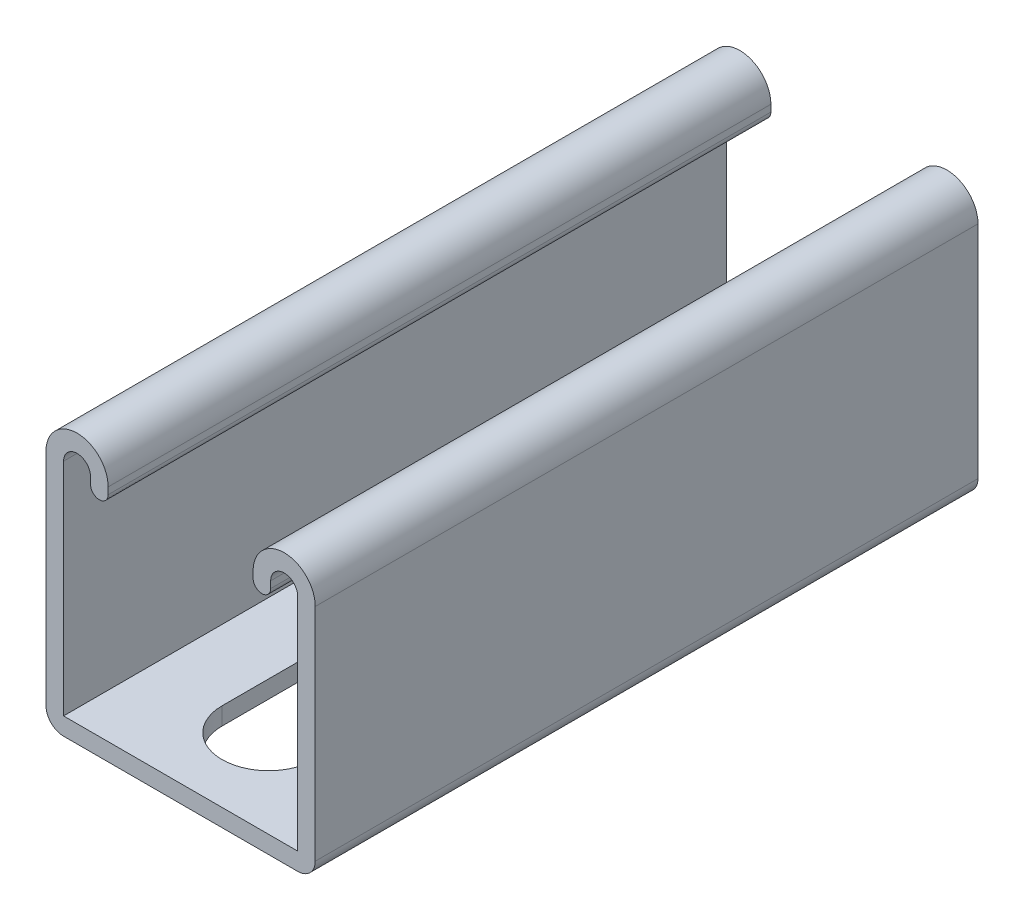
ISO-10303-21;
HEADER;
FILE_DESCRIPTION(('STEP AP214'),'2;1');
FILE_NAME('part.step','',(''),(''),'','','');
FILE_SCHEMA(('AUTOMOTIVE_DESIGN { 1 0 10303 214 1 1 1 1 }'));
ENDSEC;
DATA;
#1=APPLICATION_CONTEXT('core data for automotive mechanical design processes');
#2=APPLICATION_PROTOCOL_DEFINITION('international standard','automotive_design',2000,#1);
#3=PRODUCT_CONTEXT('',#1,'mechanical');
#4=PRODUCT('Part','Part','',(#3));
#5=PRODUCT_RELATED_PRODUCT_CATEGORY('part','',(#4));
#6=PRODUCT_DEFINITION_FORMATION('','',#4);
#7=PRODUCT_DEFINITION_CONTEXT('part definition',#1,'design');
#8=PRODUCT_DEFINITION('design','',#6,#7);
#9=PRODUCT_DEFINITION_SHAPE('','',#8);
#10=(LENGTH_UNIT() NAMED_UNIT(*) SI_UNIT(.MILLI.,.METRE.));
#11=(NAMED_UNIT(*) PLANE_ANGLE_UNIT() SI_UNIT($,.RADIAN.));
#12=(NAMED_UNIT(*) SI_UNIT($,.STERADIAN.) SOLID_ANGLE_UNIT());
#13=UNCERTAINTY_MEASURE_WITH_UNIT(LENGTH_MEASURE(1.E-05),#10,'distance_accuracy_value','');
#14=(GEOMETRIC_REPRESENTATION_CONTEXT(3) GLOBAL_UNCERTAINTY_ASSIGNED_CONTEXT((#13)) GLOBAL_UNIT_ASSIGNED_CONTEXT((#10,
#11,#12)) REPRESENTATION_CONTEXT('',''));
#15=CARTESIAN_POINT('',(0.,0.,0.));
#16=DIRECTION('',(0.,0.,1.));
#17=DIRECTION('',(1.,0.,0.));
#18=AXIS2_PLACEMENT_3D('',#15,#16,#17);
#19=CARTESIAN_POINT('',(-15.875,18.4785,101.6));
#20=DIRECTION('',(0.,0.,-1.));
#21=DIRECTION('',(-1.,0.,0.));
#22=AXIS2_PLACEMENT_3D('',#19,#20,#21);
#23=CYLINDRICAL_SURFACE('',#22,4.7625);
#24=CARTESIAN_POINT('',(-15.875,18.4785,0.));
#25=DIRECTION('',(0.,0.,1.));
#26=DIRECTION('',(-1.,0.,0.));
#27=AXIS2_PLACEMENT_3D('',#24,#25,#26);
#28=CIRCLE('',#27,4.7625);
#29=CARTESIAN_POINT('',(-11.1125,18.4785,0.));
#30=VERTEX_POINT('',#29);
#31=CARTESIAN_POINT('',(-20.6375,18.4785,0.));
#32=VERTEX_POINT('',#31);
#33=EDGE_CURVE('E253',#30,#32,#28,.T.);
#34=ORIENTED_EDGE('',*,*,#33,.T.);
#35=DIRECTION('',(0.,0.,-1.));
#36=VECTOR('',#35,1.);
#37=CARTESIAN_POINT('',(-20.6375,18.4785,101.6));
#38=LINE('',#37,#36);
#39=CARTESIAN_POINT('',(-20.6375,18.4785,101.6));
#40=VERTEX_POINT('',#39);
#41=EDGE_CURVE('E384',#40,#32,#38,.T.);
#42=ORIENTED_EDGE('',*,*,#41,.F.);
#43=CARTESIAN_POINT('',(-15.875,18.4785,101.6));
#44=DIRECTION('',(0.,0.,1.));
#45=DIRECTION('',(-1.,0.,0.));
#46=AXIS2_PLACEMENT_3D('',#43,#44,#45);
#47=CIRCLE('',#46,4.7625);
#48=CARTESIAN_POINT('',(-11.1125,18.4785,101.6));
#49=VERTEX_POINT('',#48);
#50=EDGE_CURVE('E260',#49,#40,#47,.T.);
#51=ORIENTED_EDGE('',*,*,#50,.F.);
#52=DIRECTION('',(0.,0.,-1.));
#53=VECTOR('',#52,1.);
#54=CARTESIAN_POINT('',(-11.1125,18.4785,101.6));
#55=LINE('',#54,#53);
#56=EDGE_CURVE('E298',#49,#30,#55,.T.);
#57=ORIENTED_EDGE('',*,*,#56,.T.);
#58=EDGE_LOOP('',(#34,#42,#51,#57));
#59=FACE_BOUND('',#58,.T.);
#60=ADVANCED_FACE('F32',(#59),#23,.T.);
#61=CARTESIAN_POINT('',(-20.6375,18.4785,101.6));
#62=DIRECTION('',(1.,0.,0.));
#63=DIRECTION('',(0.,1.,0.));
#64=AXIS2_PLACEMENT_3D('',#61,#62,#63);
#65=PLANE('',#64);
#66=DIRECTION('',(0.,-1.,0.));
#67=VECTOR('',#66,1.);
#68=CARTESIAN_POINT('',(-20.6375,18.4785,0.));
#69=LINE('',#68,#67);
#70=CARTESIAN_POINT('',(-20.6375,-15.3416,0.));
#71=VERTEX_POINT('',#70);
#72=EDGE_CURVE('E301',#32,#71,#69,.T.);
#73=ORIENTED_EDGE('',*,*,#72,.T.);
#74=DIRECTION('',(0.,0.,-1.));
#75=VECTOR('',#74,1.);
#76=CARTESIAN_POINT('',(-20.6375,-15.3416,101.6));
#77=LINE('',#76,#75);
#78=CARTESIAN_POINT('',(-20.6375,-15.3416,101.6));
#79=VERTEX_POINT('',#78);
#80=EDGE_CURVE('E381',#79,#71,#77,.T.);
#81=ORIENTED_EDGE('',*,*,#80,.F.);
#82=DIRECTION('',(0.,-1.,0.));
#83=VECTOR('',#82,1.);
#84=CARTESIAN_POINT('',(-20.6375,18.4785,101.6));
#85=LINE('',#84,#83);
#86=EDGE_CURVE('E263',#40,#79,#85,.T.);
#87=ORIENTED_EDGE('',*,*,#86,.F.);
#88=ORIENTED_EDGE('',*,*,#41,.T.);
#89=EDGE_LOOP('',(#73,#81,#87,#88));
#90=FACE_BOUND('',#89,.T.);
#91=ADVANCED_FACE('F425',(#90),#65,.F.);
#92=CARTESIAN_POINT('',(-17.9451,-15.3416,101.6));
#93=DIRECTION('',(0.,0.,-1.));
#94=DIRECTION('',(-1.,0.,0.));
#95=AXIS2_PLACEMENT_3D('',#92,#93,#94);
#96=CYLINDRICAL_SURFACE('',#95,2.6924);
#97=CARTESIAN_POINT('',(-17.9451,-15.3416,0.));
#98=DIRECTION('',(0.,0.,1.));
#99=DIRECTION('',(-1.,0.,0.));
#100=AXIS2_PLACEMENT_3D('',#97,#98,#99);
#101=CIRCLE('',#100,2.6924);
#102=CARTESIAN_POINT('',(-17.9451,-18.034,0.));
#103=VERTEX_POINT('',#102);
#104=EDGE_CURVE('E303',#71,#103,#101,.T.);
#105=ORIENTED_EDGE('',*,*,#104,.T.);
#106=DIRECTION('',(0.,0.,-1.));
#107=VECTOR('',#106,1.);
#108=CARTESIAN_POINT('',(-17.9451,-18.034,101.6));
#109=LINE('',#108,#107);
#110=CARTESIAN_POINT('',(-17.9451,-18.034,101.6));
#111=VERTEX_POINT('',#110);
#112=EDGE_CURVE('E378',#111,#103,#109,.T.);
#113=ORIENTED_EDGE('',*,*,#112,.F.);
#114=CARTESIAN_POINT('',(-17.9451,-15.3416,101.6));
#115=DIRECTION('',(0.,0.,1.));
#116=DIRECTION('',(-1.,0.,0.));
#117=AXIS2_PLACEMENT_3D('',#114,#115,#116);
#118=CIRCLE('',#117,2.6924);
#119=EDGE_CURVE('E266',#79,#111,#118,.T.);
#120=ORIENTED_EDGE('',*,*,#119,.F.);
#121=ORIENTED_EDGE('',*,*,#80,.T.);
#122=EDGE_LOOP('',(#105,#113,#120,#121));
#123=FACE_BOUND('',#122,.T.);
#124=ADVANCED_FACE('F430',(#123),#96,.T.);
#125=CARTESIAN_POINT('',(-17.9451,-18.034,101.6));
#126=DIRECTION('',(0.,1.,0.));
#127=DIRECTION('',(-1.,0.,0.));
#128=AXIS2_PLACEMENT_3D('',#125,#126,#127);
#129=PLANE('',#128);
#130=DIRECTION('',(0.,0.,-1.));
#131=VECTOR('',#130,1.);
#132=CARTESIAN_POINT('',(-7.14375,-18.0340000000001,73.81875));
#133=LINE('',#132,#131);
#134=CARTESIAN_POINT('',(-7.14375,-18.034,88.10625));
#135=VERTEX_POINT('',#134);
#136=CARTESIAN_POINT('',(-7.14375,-18.0340000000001,73.81875));
#137=VERTEX_POINT('',#136);
#138=EDGE_CURVE('E206',#135,#137,#133,.T.);
#139=ORIENTED_EDGE('',*,*,#138,.F.);
#140=CARTESIAN_POINT('',(0.,-18.0340000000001,88.10625));
#141=DIRECTION('',(0.,-1.,0.));
#142=DIRECTION('',(1.,0.,0.));
#143=AXIS2_PLACEMENT_3D('',#140,#141,#142);
#144=CIRCLE('',#143,7.14375);
#145=CARTESIAN_POINT('',(7.14375,-18.0340000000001,88.10625));
#146=VERTEX_POINT('',#145);
#147=EDGE_CURVE('E46',#146,#135,#144,.T.);
#148=ORIENTED_EDGE('',*,*,#147,.F.);
#149=DIRECTION('',(0.,0.,1.));
#150=VECTOR('',#149,1.);
#151=CARTESIAN_POINT('',(7.14375,-18.0340000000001,88.10625));
#152=LINE('',#151,#150);
#153=CARTESIAN_POINT('',(7.14375,-18.0340000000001,73.81875));
#154=VERTEX_POINT('',#153);
#155=EDGE_CURVE('E222',#154,#146,#152,.T.);
#156=ORIENTED_EDGE('',*,*,#155,.F.);
#157=CARTESIAN_POINT('',(0.,-18.0340000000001,73.81875));
#158=DIRECTION('',(0.,-1.,0.));
#159=DIRECTION('',(1.,0.,0.));
#160=AXIS2_PLACEMENT_3D('',#157,#158,#159);
#161=CIRCLE('',#160,7.14375);
#162=EDGE_CURVE('E216',#137,#154,#161,.T.);
#163=ORIENTED_EDGE('',*,*,#162,.F.);
#164=EDGE_LOOP('',(#139,#148,#156,#163));
#165=FACE_BOUND('',#164,.T.);
#166=DIRECTION('',(0.,0.,-1.));
#167=VECTOR('',#166,1.);
#168=CARTESIAN_POINT('',(-7.14375,-18.0340000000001,23.01875));
#169=LINE('',#168,#167);
#170=CARTESIAN_POINT('',(-7.14375,-18.034,37.30625));
#171=VERTEX_POINT('',#170);
#172=CARTESIAN_POINT('',(-7.14375,-18.0340000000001,23.01875));
#173=VERTEX_POINT('',#172);
#174=EDGE_CURVE('E241',#171,#173,#169,.T.);
#175=ORIENTED_EDGE('',*,*,#174,.F.);
#176=CARTESIAN_POINT('',(0.,-18.0340000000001,37.30625));
#177=DIRECTION('',(0.,-1.,0.));
#178=DIRECTION('',(1.,0.,0.));
#179=AXIS2_PLACEMENT_3D('',#176,#177,#178);
#180=CIRCLE('',#179,7.14375);
#181=CARTESIAN_POINT('',(7.14375,-18.0340000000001,37.30625));
#182=VERTEX_POINT('',#181);
#183=EDGE_CURVE('E239',#182,#171,#180,.T.);
#184=ORIENTED_EDGE('',*,*,#183,.F.);
#185=DIRECTION('',(0.,0.,1.));
#186=VECTOR('',#185,1.);
#187=CARTESIAN_POINT('',(7.14375,-18.0340000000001,37.30625));
#188=LINE('',#187,#186);
#189=CARTESIAN_POINT('',(7.14375,-18.0340000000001,23.01875));
#190=VERTEX_POINT('',#189);
#191=EDGE_CURVE('E247',#190,#182,#188,.T.);
#192=ORIENTED_EDGE('',*,*,#191,.F.);
#193=CARTESIAN_POINT('',(0.,-18.0340000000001,23.01875));
#194=DIRECTION('',(0.,-1.,0.));
#195=DIRECTION('',(1.,0.,0.));
#196=AXIS2_PLACEMENT_3D('',#193,#194,#195);
#197=CIRCLE('',#196,7.14375);
#198=EDGE_CURVE('E244',#173,#190,#197,.T.);
#199=ORIENTED_EDGE('',*,*,#198,.F.);
#200=EDGE_LOOP('',(#175,#184,#192,#199));
#201=FACE_BOUND('',#200,.T.);
#202=DIRECTION('',(1.,0.,0.));
#203=VECTOR('',#202,1.);
#204=CARTESIAN_POINT('',(-17.9451,-18.034,0.));
#205=LINE('',#204,#203);
#206=CARTESIAN_POINT('',(17.9451,-18.034,0.));
#207=VERTEX_POINT('',#206);
#208=EDGE_CURVE('E305',#103,#207,#205,.T.);
#209=ORIENTED_EDGE('',*,*,#208,.T.);
#210=DIRECTION('',(0.,0.,-1.));
#211=VECTOR('',#210,1.);
#212=CARTESIAN_POINT('',(17.9451,-18.034,101.6));
#213=LINE('',#212,#211);
#214=CARTESIAN_POINT('',(17.9451,-18.034,101.6));
#215=VERTEX_POINT('',#214);
#216=EDGE_CURVE('E375',#215,#207,#213,.T.);
#217=ORIENTED_EDGE('',*,*,#216,.F.);
#218=DIRECTION('',(1.,0.,0.));
#219=VECTOR('',#218,1.);
#220=CARTESIAN_POINT('',(-17.9451,-18.034,101.6));
#221=LINE('',#220,#219);
#222=EDGE_CURVE('E268',#111,#215,#221,.T.);
#223=ORIENTED_EDGE('',*,*,#222,.F.);
#224=ORIENTED_EDGE('',*,*,#112,.T.);
#225=EDGE_LOOP('',(#209,#217,#223,#224));
#226=FACE_BOUND('',#225,.T.);
#227=ADVANCED_FACE('F220',(#165,#201,#226),#129,.F.);
#228=CARTESIAN_POINT('',(17.9451,-15.3416,101.6));
#229=DIRECTION('',(0.,0.,-1.));
#230=DIRECTION('',(-1.,0.,0.));
#231=AXIS2_PLACEMENT_3D('',#228,#229,#230);
#232=CYLINDRICAL_SURFACE('',#231,2.6924);
#233=CARTESIAN_POINT('',(17.9451,-15.3416,0.));
#234=DIRECTION('',(0.,0.,1.));
#235=DIRECTION('',(1.,0.,0.));
#236=AXIS2_PLACEMENT_3D('',#233,#234,#235);
#237=CIRCLE('',#236,2.6924);
#238=CARTESIAN_POINT('',(20.6375,-15.3416,0.));
#239=VERTEX_POINT('',#238);
#240=EDGE_CURVE('E307',#207,#239,#237,.T.);
#241=ORIENTED_EDGE('',*,*,#240,.T.);
#242=DIRECTION('',(0.,0.,-1.));
#243=VECTOR('',#242,1.);
#244=CARTESIAN_POINT('',(20.6375,-15.3416,101.6));
#245=LINE('',#244,#243);
#246=CARTESIAN_POINT('',(20.6375,-15.3416,101.6));
#247=VERTEX_POINT('',#246);
#248=EDGE_CURVE('E372',#247,#239,#245,.T.);
#249=ORIENTED_EDGE('',*,*,#248,.F.);
#250=CARTESIAN_POINT('',(17.9451,-15.3416,101.6));
#251=DIRECTION('',(0.,0.,1.));
#252=DIRECTION('',(1.,0.,0.));
#253=AXIS2_PLACEMENT_3D('',#250,#251,#252);
#254=CIRCLE('',#253,2.6924);
#255=EDGE_CURVE('E270',#215,#247,#254,.T.);
#256=ORIENTED_EDGE('',*,*,#255,.F.);
#257=ORIENTED_EDGE('',*,*,#216,.T.);
#258=EDGE_LOOP('',(#241,#249,#256,#257));
#259=FACE_BOUND('',#258,.T.);
#260=ADVANCED_FACE('F510',(#259),#232,.T.);
#261=CARTESIAN_POINT('',(20.6375,-15.3416,101.6));
#262=DIRECTION('',(-1.,0.,0.));
#263=DIRECTION('',(0.,0.,1.));
#264=AXIS2_PLACEMENT_3D('',#261,#262,#263);
#265=PLANE('',#264);
#266=DIRECTION('',(0.,1.,0.));
#267=VECTOR('',#266,1.);
#268=CARTESIAN_POINT('',(20.6375,-15.3416,0.));
#269=LINE('',#268,#267);
#270=CARTESIAN_POINT('',(20.6375,18.4785,0.));
#271=VERTEX_POINT('',#270);
#272=EDGE_CURVE('E309',#239,#271,#269,.T.);
#273=ORIENTED_EDGE('',*,*,#272,.T.);
#274=DIRECTION('',(0.,0.,-1.));
#275=VECTOR('',#274,1.);
#276=CARTESIAN_POINT('',(20.6375,18.4785,101.6));
#277=LINE('',#276,#275);
#278=CARTESIAN_POINT('',(20.6375,18.4785,101.6));
#279=VERTEX_POINT('',#278);
#280=EDGE_CURVE('E369',#279,#271,#277,.T.);
#281=ORIENTED_EDGE('',*,*,#280,.F.);
#282=DIRECTION('',(0.,1.,0.));
#283=VECTOR('',#282,1.);
#284=CARTESIAN_POINT('',(20.6375,-15.3416,101.6));
#285=LINE('',#284,#283);
#286=EDGE_CURVE('E272',#247,#279,#285,.T.);
#287=ORIENTED_EDGE('',*,*,#286,.F.);
#288=ORIENTED_EDGE('',*,*,#248,.T.);
#289=EDGE_LOOP('',(#273,#281,#287,#288));
#290=FACE_BOUND('',#289,.T.);
#291=ADVANCED_FACE('F506',(#290),#265,.F.);
#292=CARTESIAN_POINT('',(15.875,18.4785,101.6));
#293=DIRECTION('',(0.,0.,-1.));
#294=DIRECTION('',(-1.,0.,0.));
#295=AXIS2_PLACEMENT_3D('',#292,#293,#294);
#296=CYLINDRICAL_SURFACE('',#295,4.7625);
#297=CARTESIAN_POINT('',(15.875,18.4785,0.));
#298=DIRECTION('',(0.,0.,1.));
#299=DIRECTION('',(1.,0.,0.));
#300=AXIS2_PLACEMENT_3D('',#297,#298,#299);
#301=CIRCLE('',#300,4.7625);
#302=CARTESIAN_POINT('',(11.1125,18.4785,0.));
#303=VERTEX_POINT('',#302);
#304=EDGE_CURVE('E311',#271,#303,#301,.T.);
#305=ORIENTED_EDGE('',*,*,#304,.T.);
#306=DIRECTION('',(0.,0.,-1.));
#307=VECTOR('',#306,1.);
#308=CARTESIAN_POINT('',(11.1125,18.4785,101.6));
#309=LINE('',#308,#307);
#310=CARTESIAN_POINT('',(11.1125,18.4785,101.6));
#311=VERTEX_POINT('',#310);
#312=EDGE_CURVE('E366',#311,#303,#309,.T.);
#313=ORIENTED_EDGE('',*,*,#312,.F.);
#314=CARTESIAN_POINT('',(15.875,18.4785,101.6));
#315=DIRECTION('',(0.,0.,1.));
#316=DIRECTION('',(1.,0.,0.));
#317=AXIS2_PLACEMENT_3D('',#314,#315,#316);
#318=CIRCLE('',#317,4.7625);
#319=EDGE_CURVE('E274',#279,#311,#318,.T.);
#320=ORIENTED_EDGE('',*,*,#319,.F.);
#321=ORIENTED_EDGE('',*,*,#280,.T.);
#322=EDGE_LOOP('',(#305,#313,#320,#321));
#323=FACE_BOUND('',#322,.T.);
#324=ADVANCED_FACE('F501',(#323),#296,.T.);
#325=CARTESIAN_POINT('',(11.1125,18.4785,101.6));
#326=DIRECTION('',(1.,0.,0.));
#327=DIRECTION('',(0.,1.,0.));
#328=AXIS2_PLACEMENT_3D('',#325,#326,#327);
#329=PLANE('',#328);
#330=DIRECTION('',(0.,-1.,0.));
#331=VECTOR('',#330,1.);
#332=CARTESIAN_POINT('',(11.1125,18.4785,0.));
#333=LINE('',#332,#331);
#334=CARTESIAN_POINT('',(11.1125,17.44345,0.));
#335=VERTEX_POINT('',#334);
#336=EDGE_CURVE('E313',#303,#335,#333,.T.);
#337=ORIENTED_EDGE('',*,*,#336,.T.);
#338=DIRECTION('',(0.,0.,-1.));
#339=VECTOR('',#338,1.);
#340=CARTESIAN_POINT('',(11.1125,17.44345,101.6));
#341=LINE('',#340,#339);
#342=CARTESIAN_POINT('',(11.1125,17.44345,101.6));
#343=VERTEX_POINT('',#342);
#344=EDGE_CURVE('E363',#343,#335,#341,.T.);
#345=ORIENTED_EDGE('',*,*,#344,.F.);
#346=DIRECTION('',(0.,-1.,0.));
#347=VECTOR('',#346,1.);
#348=CARTESIAN_POINT('',(11.1125,18.4785,101.6));
#349=LINE('',#348,#347);
#350=EDGE_CURVE('E276',#311,#343,#349,.T.);
#351=ORIENTED_EDGE('',*,*,#350,.F.);
#352=ORIENTED_EDGE('',*,*,#312,.T.);
#353=EDGE_LOOP('',(#337,#345,#351,#352));
#354=FACE_BOUND('',#353,.T.);
#355=ADVANCED_FACE('F495',(#354),#329,.F.);
#356=CARTESIAN_POINT('',(12.4587,17.44345,101.6));
#357=DIRECTION('',(0.,0.,-1.));
#358=DIRECTION('',(-1.,0.,0.));
#359=AXIS2_PLACEMENT_3D('',#356,#357,#358);
#360=CYLINDRICAL_SURFACE('',#359,1.3462);
#361=CARTESIAN_POINT('',(12.4587,17.44345,0.));
#362=DIRECTION('',(0.,0.,1.));
#363=DIRECTION('',(1.,0.,0.));
#364=AXIS2_PLACEMENT_3D('',#361,#362,#363);
#365=CIRCLE('',#364,1.3462);
#366=CARTESIAN_POINT('',(13.8049,17.44345,0.));
#367=VERTEX_POINT('',#366);
#368=EDGE_CURVE('E315',#335,#367,#365,.T.);
#369=ORIENTED_EDGE('',*,*,#368,.T.);
#370=DIRECTION('',(0.,0.,-1.));
#371=VECTOR('',#370,1.);
#372=CARTESIAN_POINT('',(13.8049,17.44345,101.6));
#373=LINE('',#372,#371);
#374=CARTESIAN_POINT('',(13.8049,17.44345,101.6));
#375=VERTEX_POINT('',#374);
#376=EDGE_CURVE('E360',#375,#367,#373,.T.);
#377=ORIENTED_EDGE('',*,*,#376,.F.);
#378=CARTESIAN_POINT('',(12.4587,17.44345,101.6));
#379=DIRECTION('',(0.,0.,1.));
#380=DIRECTION('',(1.,0.,0.));
#381=AXIS2_PLACEMENT_3D('',#378,#379,#380);
#382=CIRCLE('',#381,1.3462);
#383=EDGE_CURVE('E278',#343,#375,#382,.T.);
#384=ORIENTED_EDGE('',*,*,#383,.F.);
#385=ORIENTED_EDGE('',*,*,#344,.T.);
#386=EDGE_LOOP('',(#369,#377,#384,#385));
#387=FACE_BOUND('',#386,.T.);
#388=ADVANCED_FACE('F491',(#387),#360,.T.);
#389=CARTESIAN_POINT('',(13.8049,18.4785,101.6));
#390=DIRECTION('',(-1.,0.,0.));
#391=DIRECTION('',(0.,0.,1.));
#392=AXIS2_PLACEMENT_3D('',#389,#390,#391);
#393=PLANE('',#392);
#394=DIRECTION('',(0.,1.,0.));
#395=VECTOR('',#394,1.);
#396=CARTESIAN_POINT('',(13.8049,18.4785,0.));
#397=LINE('',#396,#395);
#398=CARTESIAN_POINT('',(13.8049,18.4785,0.));
#399=VERTEX_POINT('',#398);
#400=EDGE_CURVE('E317',#367,#399,#397,.T.);
#401=ORIENTED_EDGE('',*,*,#400,.T.);
#402=DIRECTION('',(0.,0.,-1.));
#403=VECTOR('',#402,1.);
#404=CARTESIAN_POINT('',(13.8049,18.4785,101.6));
#405=LINE('',#404,#403);
#406=CARTESIAN_POINT('',(13.8049,18.4785,101.6));
#407=VERTEX_POINT('',#406);
#408=EDGE_CURVE('E357',#407,#399,#405,.T.);
#409=ORIENTED_EDGE('',*,*,#408,.F.);
#410=DIRECTION('',(0.,1.,0.));
#411=VECTOR('',#410,1.);
#412=CARTESIAN_POINT('',(13.8049,18.4785,101.6));
#413=LINE('',#412,#411);
#414=EDGE_CURVE('E280',#375,#407,#413,.T.);
#415=ORIENTED_EDGE('',*,*,#414,.F.);
#416=ORIENTED_EDGE('',*,*,#376,.T.);
#417=EDGE_LOOP('',(#401,#409,#415,#416));
#418=FACE_BOUND('',#417,.T.);
#419=ADVANCED_FACE('F486',(#418),#393,.F.);
#420=CARTESIAN_POINT('',(15.875,18.4785,101.6));
#421=DIRECTION('',(0.,0.,-1.));
#422=DIRECTION('',(-1.,0.,0.));
#423=AXIS2_PLACEMENT_3D('',#420,#421,#422);
#424=CYLINDRICAL_SURFACE('',#423,2.0701);
#425=CARTESIAN_POINT('',(15.875,18.4785,0.));
#426=DIRECTION('',(0.,0.,-1.));
#427=DIRECTION('',(1.,0.,0.));
#428=AXIS2_PLACEMENT_3D('',#425,#426,#427);
#429=CIRCLE('',#428,2.0701);
#430=CARTESIAN_POINT('',(17.9451,18.4785,0.));
#431=VERTEX_POINT('',#430);
#432=EDGE_CURVE('E319',#399,#431,#429,.T.);
#433=ORIENTED_EDGE('',*,*,#432,.T.);
#434=DIRECTION('',(0.,0.,-1.));
#435=VECTOR('',#434,1.);
#436=CARTESIAN_POINT('',(17.9451,18.4785,101.6));
#437=LINE('',#436,#435);
#438=CARTESIAN_POINT('',(17.9451,18.4785,101.6));
#439=VERTEX_POINT('',#438);
#440=EDGE_CURVE('E354',#439,#431,#437,.T.);
#441=ORIENTED_EDGE('',*,*,#440,.F.);
#442=CARTESIAN_POINT('',(15.875,18.4785,101.6));
#443=DIRECTION('',(0.,0.,-1.));
#444=DIRECTION('',(1.,0.,0.));
#445=AXIS2_PLACEMENT_3D('',#442,#443,#444);
#446=CIRCLE('',#445,2.0701);
#447=EDGE_CURVE('E282',#407,#439,#446,.T.);
#448=ORIENTED_EDGE('',*,*,#447,.F.);
#449=ORIENTED_EDGE('',*,*,#408,.T.);
#450=EDGE_LOOP('',(#433,#441,#448,#449));
#451=FACE_BOUND('',#450,.T.);
#452=ADVANCED_FACE('F480',(#451),#424,.F.);
#453=CARTESIAN_POINT('',(17.9451,-15.3416,101.6));
#454=DIRECTION('',(1.,0.,0.));
#455=DIRECTION('',(0.,1.,0.));
#456=AXIS2_PLACEMENT_3D('',#453,#454,#455);
#457=PLANE('',#456);
#458=DIRECTION('',(0.,-1.,0.));
#459=VECTOR('',#458,1.);
#460=CARTESIAN_POINT('',(17.9451,-15.3416,0.));
#461=LINE('',#460,#459);
#462=CARTESIAN_POINT('',(17.9451,-15.3416,0.));
#463=VERTEX_POINT('',#462);
#464=EDGE_CURVE('E321',#431,#463,#461,.T.);
#465=ORIENTED_EDGE('',*,*,#464,.T.);
#466=DIRECTION('',(0.,0.,-1.));
#467=VECTOR('',#466,1.);
#468=CARTESIAN_POINT('',(17.9451,-15.3416,101.6));
#469=LINE('',#468,#467);
#470=CARTESIAN_POINT('',(17.9451,-15.3416,101.6));
#471=VERTEX_POINT('',#470);
#472=EDGE_CURVE('E351',#471,#463,#469,.T.);
#473=ORIENTED_EDGE('',*,*,#472,.F.);
#474=DIRECTION('',(0.,-1.,0.));
#475=VECTOR('',#474,1.);
#476=CARTESIAN_POINT('',(17.9451,-15.3416,101.6));
#477=LINE('',#476,#475);
#478=EDGE_CURVE('E284',#439,#471,#477,.T.);
#479=ORIENTED_EDGE('',*,*,#478,.F.);
#480=ORIENTED_EDGE('',*,*,#440,.T.);
#481=EDGE_LOOP('',(#465,#473,#479,#480));
#482=FACE_BOUND('',#481,.T.);
#483=ADVANCED_FACE('F476',(#482),#457,.F.);
#484=CARTESIAN_POINT('',(-17.9451,-15.3416,101.6));
#485=DIRECTION('',(0.,-1.,0.));
#486=DIRECTION('',(1.,0.,0.));
#487=AXIS2_PLACEMENT_3D('',#484,#485,#486);
#488=PLANE('',#487);
#489=DIRECTION('',(0.,0.,1.));
#490=VECTOR('',#489,1.);
#491=CARTESIAN_POINT('',(7.14375,-15.3416,152.4));
#492=LINE('',#491,#490);
#493=CARTESIAN_POINT('',(7.14375,-15.3416,73.81875));
#494=VERTEX_POINT('',#493);
#495=CARTESIAN_POINT('',(7.14375,-15.3416,88.10625));
#496=VERTEX_POINT('',#495);
#497=EDGE_CURVE('E232',#494,#496,#492,.T.);
#498=ORIENTED_EDGE('',*,*,#497,.T.);
#499=CARTESIAN_POINT('',(0.,-15.3416,88.10625));
#500=DIRECTION('',(0.,-1.,0.));
#501=DIRECTION('',(1.,0.,0.));
#502=AXIS2_PLACEMENT_3D('',#499,#500,#501);
#503=CIRCLE('',#502,7.14375);
#504=CARTESIAN_POINT('',(-7.14375,-15.3416,88.10625));
#505=VERTEX_POINT('',#504);
#506=EDGE_CURVE('E236',#496,#505,#503,.T.);
#507=ORIENTED_EDGE('',*,*,#506,.T.);
#508=DIRECTION('',(0.,0.,-1.));
#509=VECTOR('',#508,1.);
#510=CARTESIAN_POINT('',(-7.14375,-15.3416,152.4));
#511=LINE('',#510,#509);
#512=CARTESIAN_POINT('',(-7.14375,-15.3416,73.81875));
#513=VERTEX_POINT('',#512);
#514=EDGE_CURVE('E213',#505,#513,#511,.T.);
#515=ORIENTED_EDGE('',*,*,#514,.T.);
#516=CARTESIAN_POINT('',(0.,-15.3416,73.81875));
#517=DIRECTION('',(0.,-1.,0.));
#518=DIRECTION('',(1.,0.,0.));
#519=AXIS2_PLACEMENT_3D('',#516,#517,#518);
#520=CIRCLE('',#519,7.14375);
#521=EDGE_CURVE('E54',#513,#494,#520,.T.);
#522=ORIENTED_EDGE('',*,*,#521,.T.);
#523=EDGE_LOOP('',(#498,#507,#515,#522));
#524=FACE_BOUND('',#523,.T.);
#525=DIRECTION('',(0.,0.,1.));
#526=VECTOR('',#525,1.);
#527=CARTESIAN_POINT('',(7.14375,-15.3416,101.6));
#528=LINE('',#527,#526);
#529=CARTESIAN_POINT('',(7.14375,-15.3416,23.01875));
#530=VERTEX_POINT('',#529);
#531=CARTESIAN_POINT('',(7.14375,-15.3416,37.30625));
#532=VERTEX_POINT('',#531);
#533=EDGE_CURVE('E39',#530,#532,#528,.T.);
#534=ORIENTED_EDGE('',*,*,#533,.T.);
#535=CARTESIAN_POINT('',(0.,-15.3416,37.30625));
#536=DIRECTION('',(0.,-1.,0.));
#537=DIRECTION('',(1.,0.,0.));
#538=AXIS2_PLACEMENT_3D('',#535,#536,#537);
#539=CIRCLE('',#538,7.14375);
#540=CARTESIAN_POINT('',(-7.14375,-15.3416,37.30625));
#541=VERTEX_POINT('',#540);
#542=EDGE_CURVE('E11',#532,#541,#539,.T.);
#543=ORIENTED_EDGE('',*,*,#542,.T.);
#544=DIRECTION('',(0.,0.,-1.));
#545=VECTOR('',#544,1.);
#546=CARTESIAN_POINT('',(-7.14375,-15.3416,101.6));
#547=LINE('',#546,#545);
#548=CARTESIAN_POINT('',(-7.14375,-15.3416,23.01875));
#549=VERTEX_POINT('',#548);
#550=EDGE_CURVE('E387',#541,#549,#547,.T.);
#551=ORIENTED_EDGE('',*,*,#550,.T.);
#552=CARTESIAN_POINT('',(0.,-15.3416,23.01875));
#553=DIRECTION('',(0.,-1.,0.));
#554=DIRECTION('',(1.,0.,0.));
#555=AXIS2_PLACEMENT_3D('',#552,#553,#554);
#556=CIRCLE('',#555,7.14375);
#557=EDGE_CURVE('E390',#549,#530,#556,.T.);
#558=ORIENTED_EDGE('',*,*,#557,.T.);
#559=EDGE_LOOP('',(#534,#543,#551,#558));
#560=FACE_BOUND('',#559,.T.);
#561=DIRECTION('',(-1.,0.,0.));
#562=VECTOR('',#561,1.);
#563=CARTESIAN_POINT('',(-17.9451,-15.3416,0.));
#564=LINE('',#563,#562);
#565=CARTESIAN_POINT('',(-17.9451,-15.3416,0.));
#566=VERTEX_POINT('',#565);
#567=EDGE_CURVE('E323',#463,#566,#564,.T.);
#568=ORIENTED_EDGE('',*,*,#567,.T.);
#569=DIRECTION('',(0.,0.,-1.));
#570=VECTOR('',#569,1.);
#571=CARTESIAN_POINT('',(-17.9451,-15.3416,101.6));
#572=LINE('',#571,#570);
#573=CARTESIAN_POINT('',(-17.9451,-15.3416,101.6));
#574=VERTEX_POINT('',#573);
#575=EDGE_CURVE('E348',#574,#566,#572,.T.);
#576=ORIENTED_EDGE('',*,*,#575,.F.);
#577=DIRECTION('',(-1.,0.,0.));
#578=VECTOR('',#577,1.);
#579=CARTESIAN_POINT('',(-17.9451,-15.3416,101.6));
#580=LINE('',#579,#578);
#581=EDGE_CURVE('E286',#471,#574,#580,.T.);
#582=ORIENTED_EDGE('',*,*,#581,.F.);
#583=ORIENTED_EDGE('',*,*,#472,.T.);
#584=EDGE_LOOP('',(#568,#576,#582,#583));
#585=FACE_BOUND('',#584,.T.);
#586=ADVANCED_FACE('F394',(#524,#560,#585),#488,.F.);
#587=CARTESIAN_POINT('',(-17.9451,18.4785,101.6));
#588=DIRECTION('',(-1.,0.,0.));
#589=DIRECTION('',(0.,-1.,0.));
#590=AXIS2_PLACEMENT_3D('',#587,#588,#589);
#591=PLANE('',#590);
#592=DIRECTION('',(0.,1.,0.));
#593=VECTOR('',#592,1.);
#594=CARTESIAN_POINT('',(-17.9451,18.4785,0.));
#595=LINE('',#594,#593);
#596=CARTESIAN_POINT('',(-17.9451,18.4785,0.));
#597=VERTEX_POINT('',#596);
#598=EDGE_CURVE('E325',#566,#597,#595,.T.);
#599=ORIENTED_EDGE('',*,*,#598,.T.);
#600=DIRECTION('',(0.,0.,-1.));
#601=VECTOR('',#600,1.);
#602=CARTESIAN_POINT('',(-17.9451,18.4785,101.6));
#603=LINE('',#602,#601);
#604=CARTESIAN_POINT('',(-17.9451,18.4785,101.6));
#605=VERTEX_POINT('',#604);
#606=EDGE_CURVE('E345',#605,#597,#603,.T.);
#607=ORIENTED_EDGE('',*,*,#606,.F.);
#608=DIRECTION('',(0.,1.,0.));
#609=VECTOR('',#608,1.);
#610=CARTESIAN_POINT('',(-17.9451,18.4785,101.6));
#611=LINE('',#610,#609);
#612=EDGE_CURVE('E288',#574,#605,#611,.T.);
#613=ORIENTED_EDGE('',*,*,#612,.F.);
#614=ORIENTED_EDGE('',*,*,#575,.T.);
#615=EDGE_LOOP('',(#599,#607,#613,#614));
#616=FACE_BOUND('',#615,.T.);
#617=ADVANCED_FACE('F467',(#616),#591,.F.);
#618=CARTESIAN_POINT('',(-15.875,18.4785,101.6));
#619=DIRECTION('',(0.,0.,-1.));
#620=DIRECTION('',(-1.,0.,0.));
#621=AXIS2_PLACEMENT_3D('',#618,#619,#620);
#622=CYLINDRICAL_SURFACE('',#621,2.0701);
#623=CARTESIAN_POINT('',(-15.875,18.4785,0.));
#624=DIRECTION('',(0.,0.,-1.));
#625=DIRECTION('',(-1.,0.,0.));
#626=AXIS2_PLACEMENT_3D('',#623,#624,#625);
#627=CIRCLE('',#626,2.0701);
#628=CARTESIAN_POINT('',(-13.8049,18.4785,0.));
#629=VERTEX_POINT('',#628);
#630=EDGE_CURVE('E327',#597,#629,#627,.T.);
#631=ORIENTED_EDGE('',*,*,#630,.T.);
#632=DIRECTION('',(0.,0.,-1.));
#633=VECTOR('',#632,1.);
#634=CARTESIAN_POINT('',(-13.8049,18.4785,101.6));
#635=LINE('',#634,#633);
#636=CARTESIAN_POINT('',(-13.8049,18.4785,101.6));
#637=VERTEX_POINT('',#636);
#638=EDGE_CURVE('E342',#637,#629,#635,.T.);
#639=ORIENTED_EDGE('',*,*,#638,.F.);
#640=CARTESIAN_POINT('',(-15.875,18.4785,101.6));
#641=DIRECTION('',(0.,0.,-1.));
#642=DIRECTION('',(-1.,0.,0.));
#643=AXIS2_PLACEMENT_3D('',#640,#641,#642);
#644=CIRCLE('',#643,2.0701);
#645=EDGE_CURVE('E290',#605,#637,#644,.T.);
#646=ORIENTED_EDGE('',*,*,#645,.F.);
#647=ORIENTED_EDGE('',*,*,#606,.T.);
#648=EDGE_LOOP('',(#631,#639,#646,#647));
#649=FACE_BOUND('',#648,.T.);
#650=ADVANCED_FACE('F463',(#649),#622,.F.);
#651=CARTESIAN_POINT('',(-13.8049,18.4785,101.6));
#652=DIRECTION('',(1.,0.,0.));
#653=DIRECTION('',(0.,1.,0.));
#654=AXIS2_PLACEMENT_3D('',#651,#652,#653);
#655=PLANE('',#654);
#656=DIRECTION('',(0.,-1.,0.));
#657=VECTOR('',#656,1.);
#658=CARTESIAN_POINT('',(-13.8049,18.4785,0.));
#659=LINE('',#658,#657);
#660=CARTESIAN_POINT('',(-13.8049,17.44345,0.));
#661=VERTEX_POINT('',#660);
#662=EDGE_CURVE('E329',#629,#661,#659,.T.);
#663=ORIENTED_EDGE('',*,*,#662,.T.);
#664=DIRECTION('',(0.,0.,-1.));
#665=VECTOR('',#664,1.);
#666=CARTESIAN_POINT('',(-13.8049,17.44345,101.6));
#667=LINE('',#666,#665);
#668=CARTESIAN_POINT('',(-13.8049,17.44345,101.6));
#669=VERTEX_POINT('',#668);
#670=EDGE_CURVE('E339',#669,#661,#667,.T.);
#671=ORIENTED_EDGE('',*,*,#670,.F.);
#672=DIRECTION('',(0.,-1.,0.));
#673=VECTOR('',#672,1.);
#674=CARTESIAN_POINT('',(-13.8049,18.4785,101.6));
#675=LINE('',#674,#673);
#676=EDGE_CURVE('E292',#637,#669,#675,.T.);
#677=ORIENTED_EDGE('',*,*,#676,.F.);
#678=ORIENTED_EDGE('',*,*,#638,.T.);
#679=EDGE_LOOP('',(#663,#671,#677,#678));
#680=FACE_BOUND('',#679,.T.);
#681=ADVANCED_FACE('F458',(#680),#655,.F.);
#682=CARTESIAN_POINT('',(-12.4587,17.44345,101.6));
#683=DIRECTION('',(0.,0.,-1.));
#684=DIRECTION('',(-1.,0.,0.));
#685=AXIS2_PLACEMENT_3D('',#682,#683,#684);
#686=CYLINDRICAL_SURFACE('',#685,1.3462);
#687=CARTESIAN_POINT('',(-12.4587,17.44345,0.));
#688=DIRECTION('',(0.,0.,1.));
#689=DIRECTION('',(-1.,0.,0.));
#690=AXIS2_PLACEMENT_3D('',#687,#688,#689);
#691=CIRCLE('',#690,1.3462);
#692=CARTESIAN_POINT('',(-11.1125,17.44345,0.));
#693=VERTEX_POINT('',#692);
#694=EDGE_CURVE('E331',#661,#693,#691,.T.);
#695=ORIENTED_EDGE('',*,*,#694,.T.);
#696=DIRECTION('',(0.,0.,-1.));
#697=VECTOR('',#696,1.);
#698=CARTESIAN_POINT('',(-11.1125,17.44345,101.6));
#699=LINE('',#698,#697);
#700=CARTESIAN_POINT('',(-11.1125,17.44345,101.6));
#701=VERTEX_POINT('',#700);
#702=EDGE_CURVE('E336',#701,#693,#699,.T.);
#703=ORIENTED_EDGE('',*,*,#702,.F.);
#704=CARTESIAN_POINT('',(-12.4587,17.44345,101.6));
#705=DIRECTION('',(0.,0.,1.));
#706=DIRECTION('',(-1.,0.,0.));
#707=AXIS2_PLACEMENT_3D('',#704,#705,#706);
#708=CIRCLE('',#707,1.3462);
#709=EDGE_CURVE('E294',#669,#701,#708,.T.);
#710=ORIENTED_EDGE('',*,*,#709,.F.);
#711=ORIENTED_EDGE('',*,*,#670,.T.);
#712=EDGE_LOOP('',(#695,#703,#710,#711));
#713=FACE_BOUND('',#712,.T.);
#714=ADVANCED_FACE('F452',(#713),#686,.T.);
#715=CARTESIAN_POINT('',(-11.1125,18.4785,101.6));
#716=DIRECTION('',(-1.,0.,0.));
#717=DIRECTION('',(0.,0.,1.));
#718=AXIS2_PLACEMENT_3D('',#715,#716,#717);
#719=PLANE('',#718);
#720=DIRECTION('',(0.,1.,0.));
#721=VECTOR('',#720,1.);
#722=CARTESIAN_POINT('',(-11.1125,18.4785,0.));
#723=LINE('',#722,#721);
#724=EDGE_CURVE('E264',#693,#30,#723,.T.);
#725=ORIENTED_EDGE('',*,*,#724,.T.);
#726=ORIENTED_EDGE('',*,*,#56,.F.);
#727=DIRECTION('',(0.,1.,0.));
#728=VECTOR('',#727,1.);
#729=CARTESIAN_POINT('',(-11.1125,18.4785,101.6));
#730=LINE('',#729,#728);
#731=EDGE_CURVE('E296',#701,#49,#730,.T.);
#732=ORIENTED_EDGE('',*,*,#731,.F.);
#733=ORIENTED_EDGE('',*,*,#702,.T.);
#734=EDGE_LOOP('',(#725,#726,#732,#733));
#735=FACE_BOUND('',#734,.T.);
#736=ADVANCED_FACE('F450',(#735),#719,.F.);
#737=CARTESIAN_POINT('',(-15.875,18.4785,101.6));
#738=DIRECTION('',(0.,0.,-1.));
#739=DIRECTION('',(-1.,0.,0.));
#740=AXIS2_PLACEMENT_3D('',#737,#738,#739);
#741=PLANE('',#740);
#742=ORIENTED_EDGE('',*,*,#50,.T.);
#743=ORIENTED_EDGE('',*,*,#86,.T.);
#744=ORIENTED_EDGE('',*,*,#119,.T.);
#745=ORIENTED_EDGE('',*,*,#222,.T.);
#746=ORIENTED_EDGE('',*,*,#255,.T.);
#747=ORIENTED_EDGE('',*,*,#286,.T.);
#748=ORIENTED_EDGE('',*,*,#319,.T.);
#749=ORIENTED_EDGE('',*,*,#350,.T.);
#750=ORIENTED_EDGE('',*,*,#383,.T.);
#751=ORIENTED_EDGE('',*,*,#414,.T.);
#752=ORIENTED_EDGE('',*,*,#447,.T.);
#753=ORIENTED_EDGE('',*,*,#478,.T.);
#754=ORIENTED_EDGE('',*,*,#581,.T.);
#755=ORIENTED_EDGE('',*,*,#612,.T.);
#756=ORIENTED_EDGE('',*,*,#645,.T.);
#757=ORIENTED_EDGE('',*,*,#676,.T.);
#758=ORIENTED_EDGE('',*,*,#709,.T.);
#759=ORIENTED_EDGE('',*,*,#731,.T.);
#760=EDGE_LOOP('',(#742,#743,#744,#745,#746,#747,#748,#749,#750,#751,#752,#753,#754,#755,#756,
#757,#758,#759));
#761=FACE_BOUND('',#760,.T.);
#762=ADVANCED_FACE('F445',(#761),#741,.F.);
#763=CARTESIAN_POINT('',(-15.875,18.4785,0.));
#764=DIRECTION('',(0.,0.,-1.));
#765=DIRECTION('',(-1.,0.,0.));
#766=AXIS2_PLACEMENT_3D('',#763,#764,#765);
#767=PLANE('',#766);
#768=ORIENTED_EDGE('',*,*,#33,.F.);
#769=ORIENTED_EDGE('',*,*,#724,.F.);
#770=ORIENTED_EDGE('',*,*,#694,.F.);
#771=ORIENTED_EDGE('',*,*,#662,.F.);
#772=ORIENTED_EDGE('',*,*,#630,.F.);
#773=ORIENTED_EDGE('',*,*,#598,.F.);
#774=ORIENTED_EDGE('',*,*,#567,.F.);
#775=ORIENTED_EDGE('',*,*,#464,.F.);
#776=ORIENTED_EDGE('',*,*,#432,.F.);
#777=ORIENTED_EDGE('',*,*,#400,.F.);
#778=ORIENTED_EDGE('',*,*,#368,.F.);
#779=ORIENTED_EDGE('',*,*,#336,.F.);
#780=ORIENTED_EDGE('',*,*,#304,.F.);
#781=ORIENTED_EDGE('',*,*,#272,.F.);
#782=ORIENTED_EDGE('',*,*,#240,.F.);
#783=ORIENTED_EDGE('',*,*,#208,.F.);
#784=ORIENTED_EDGE('',*,*,#104,.F.);
#785=ORIENTED_EDGE('',*,*,#72,.F.);
#786=EDGE_LOOP('',(#768,#769,#770,#771,#772,#773,#774,#775,#776,#777,#778,#779,#780,#781,#782,
#783,#784,#785));
#787=FACE_BOUND('',#786,.T.);
#788=ADVANCED_FACE('F438',(#787),#767,.T.);
#789=CARTESIAN_POINT('',(0.,23.241,37.30625));
#790=DIRECTION('',(0.,-1.,0.));
#791=DIRECTION('',(1.,0.,0.));
#792=AXIS2_PLACEMENT_3D('',#789,#790,#791);
#793=CYLINDRICAL_SURFACE('',#792,7.14375);
#794=DIRECTION('',(0.,-1.,0.));
#795=VECTOR('',#794,1.);
#796=CARTESIAN_POINT('',(7.14375,23.241,37.30625));
#797=LINE('',#796,#795);
#798=EDGE_CURVE('E251',#532,#182,#797,.T.);
#799=ORIENTED_EDGE('',*,*,#798,.T.);
#800=ORIENTED_EDGE('',*,*,#183,.T.);
#801=DIRECTION('',(0.,-1.,0.));
#802=VECTOR('',#801,1.);
#803=CARTESIAN_POINT('',(-7.14375,23.241,37.30625));
#804=LINE('',#803,#802);
#805=EDGE_CURVE('E250',#541,#171,#804,.T.);
#806=ORIENTED_EDGE('',*,*,#805,.F.);
#807=ORIENTED_EDGE('',*,*,#542,.F.);
#808=EDGE_LOOP('',(#799,#800,#806,#807));
#809=FACE_BOUND('',#808,.T.);
#810=ADVANCED_FACE('F410',(#809),#793,.F.);
#811=CARTESIAN_POINT('',(7.14375,23.241,37.30625));
#812=DIRECTION('',(1.,0.,0.));
#813=DIRECTION('',(0.,1.,0.));
#814=AXIS2_PLACEMENT_3D('',#811,#812,#813);
#815=PLANE('',#814);
#816=DIRECTION('',(0.,-1.,0.));
#817=VECTOR('',#816,1.);
#818=CARTESIAN_POINT('',(7.14375,23.241,23.01875));
#819=LINE('',#818,#817);
#820=EDGE_CURVE('E254',#530,#190,#819,.T.);
#821=ORIENTED_EDGE('',*,*,#820,.T.);
#822=ORIENTED_EDGE('',*,*,#191,.T.);
#823=ORIENTED_EDGE('',*,*,#798,.F.);
#824=ORIENTED_EDGE('',*,*,#533,.F.);
#825=EDGE_LOOP('',(#821,#822,#823,#824));
#826=FACE_BOUND('',#825,.T.);
#827=ADVANCED_FACE('F400',(#826),#815,.F.);
#828=CARTESIAN_POINT('',(0.,23.241,23.01875));
#829=DIRECTION('',(0.,-1.,0.));
#830=DIRECTION('',(1.,0.,0.));
#831=AXIS2_PLACEMENT_3D('',#828,#829,#830);
#832=CYLINDRICAL_SURFACE('',#831,7.14375);
#833=DIRECTION('',(0.,-1.,0.));
#834=VECTOR('',#833,1.);
#835=CARTESIAN_POINT('',(-7.14375,23.241,23.01875));
#836=LINE('',#835,#834);
#837=EDGE_CURVE('E256',#549,#173,#836,.T.);
#838=ORIENTED_EDGE('',*,*,#837,.T.);
#839=ORIENTED_EDGE('',*,*,#198,.T.);
#840=ORIENTED_EDGE('',*,*,#820,.F.);
#841=ORIENTED_EDGE('',*,*,#557,.F.);
#842=EDGE_LOOP('',(#838,#839,#840,#841));
#843=FACE_BOUND('',#842,.T.);
#844=ADVANCED_FACE('F402',(#843),#832,.F.);
#845=CARTESIAN_POINT('',(-7.14375,23.241,23.01875));
#846=DIRECTION('',(-1.,0.,0.));
#847=DIRECTION('',(0.,-1.,0.));
#848=AXIS2_PLACEMENT_3D('',#845,#846,#847);
#849=PLANE('',#848);
#850=ORIENTED_EDGE('',*,*,#805,.T.);
#851=ORIENTED_EDGE('',*,*,#174,.T.);
#852=ORIENTED_EDGE('',*,*,#837,.F.);
#853=ORIENTED_EDGE('',*,*,#550,.F.);
#854=EDGE_LOOP('',(#850,#851,#852,#853));
#855=FACE_BOUND('',#854,.T.);
#856=ADVANCED_FACE('F412',(#855),#849,.F.);
#857=CARTESIAN_POINT('',(0.,23.241,88.10625));
#858=DIRECTION('',(0.,-1.,0.));
#859=DIRECTION('',(1.,0.,0.));
#860=AXIS2_PLACEMENT_3D('',#857,#858,#859);
#861=CYLINDRICAL_SURFACE('',#860,7.14375);
#862=DIRECTION('',(0.,-1.,0.));
#863=VECTOR('',#862,1.);
#864=CARTESIAN_POINT('',(7.14375,23.241,88.10625));
#865=LINE('',#864,#863);
#866=EDGE_CURVE('E230',#496,#146,#865,.T.);
#867=ORIENTED_EDGE('',*,*,#866,.T.);
#868=ORIENTED_EDGE('',*,*,#147,.T.);
#869=DIRECTION('',(0.,-1.,0.));
#870=VECTOR('',#869,1.);
#871=CARTESIAN_POINT('',(-7.14375,23.241,88.10625));
#872=LINE('',#871,#870);
#873=EDGE_CURVE('E210',#505,#135,#872,.T.);
#874=ORIENTED_EDGE('',*,*,#873,.F.);
#875=ORIENTED_EDGE('',*,*,#506,.F.);
#876=EDGE_LOOP('',(#867,#868,#874,#875));
#877=FACE_BOUND('',#876,.T.);
#878=ADVANCED_FACE('F414',(#877),#861,.F.);
#879=CARTESIAN_POINT('',(7.14375,23.241,88.10625));
#880=DIRECTION('',(1.,0.,0.));
#881=DIRECTION('',(0.,1.,0.));
#882=AXIS2_PLACEMENT_3D('',#879,#880,#881);
#883=PLANE('',#882);
#884=DIRECTION('',(0.,-1.,0.));
#885=VECTOR('',#884,1.);
#886=CARTESIAN_POINT('',(7.14375,23.241,73.81875));
#887=LINE('',#886,#885);
#888=EDGE_CURVE('E223',#494,#154,#887,.T.);
#889=ORIENTED_EDGE('',*,*,#888,.T.);
#890=ORIENTED_EDGE('',*,*,#155,.T.);
#891=ORIENTED_EDGE('',*,*,#866,.F.);
#892=ORIENTED_EDGE('',*,*,#497,.F.);
#893=EDGE_LOOP('',(#889,#890,#891,#892));
#894=FACE_BOUND('',#893,.T.);
#895=ADVANCED_FACE('F420',(#894),#883,.F.);
#896=CARTESIAN_POINT('',(0.,23.241,73.81875));
#897=DIRECTION('',(0.,-1.,0.));
#898=DIRECTION('',(1.,0.,0.));
#899=AXIS2_PLACEMENT_3D('',#896,#897,#898);
#900=CYLINDRICAL_SURFACE('',#899,7.14375);
#901=DIRECTION('',(0.,-1.,0.));
#902=VECTOR('',#901,1.);
#903=CARTESIAN_POINT('',(-7.14375,23.241,73.81875));
#904=LINE('',#903,#902);
#905=EDGE_CURVE('E208',#513,#137,#904,.T.);
#906=ORIENTED_EDGE('',*,*,#905,.T.);
#907=ORIENTED_EDGE('',*,*,#162,.T.);
#908=ORIENTED_EDGE('',*,*,#888,.F.);
#909=ORIENTED_EDGE('',*,*,#521,.F.);
#910=EDGE_LOOP('',(#906,#907,#908,#909));
#911=FACE_BOUND('',#910,.T.);
#912=ADVANCED_FACE('F215',(#911),#900,.F.);
#913=CARTESIAN_POINT('',(-7.14375,23.241,73.81875));
#914=DIRECTION('',(-1.,0.,0.));
#915=DIRECTION('',(0.,-1.,0.));
#916=AXIS2_PLACEMENT_3D('',#913,#914,#915);
#917=PLANE('',#916);
#918=ORIENTED_EDGE('',*,*,#873,.T.);
#919=ORIENTED_EDGE('',*,*,#138,.T.);
#920=ORIENTED_EDGE('',*,*,#905,.F.);
#921=ORIENTED_EDGE('',*,*,#514,.F.);
#922=EDGE_LOOP('',(#918,#919,#920,#921));
#923=FACE_BOUND('',#922,.T.);
#924=ADVANCED_FACE('F207',(#923),#917,.F.);
#925=CLOSED_SHELL('',(#60,#91,#124,#227,#260,#291,#324,#355,#388,#419,#452,#483,#586,#617,#650,
#681,#714,#736,#762,#788,#810,#827,#844,#856,#878,#895,#912,#924));
#926=MANIFOLD_SOLID_BREP('B2',#925);
#927=ADVANCED_BREP_SHAPE_REPRESENTATION('',(#18,#926),#14);
#928=SHAPE_DEFINITION_REPRESENTATION(#9,#927);
ENDSEC;
END-ISO-10303-21;
